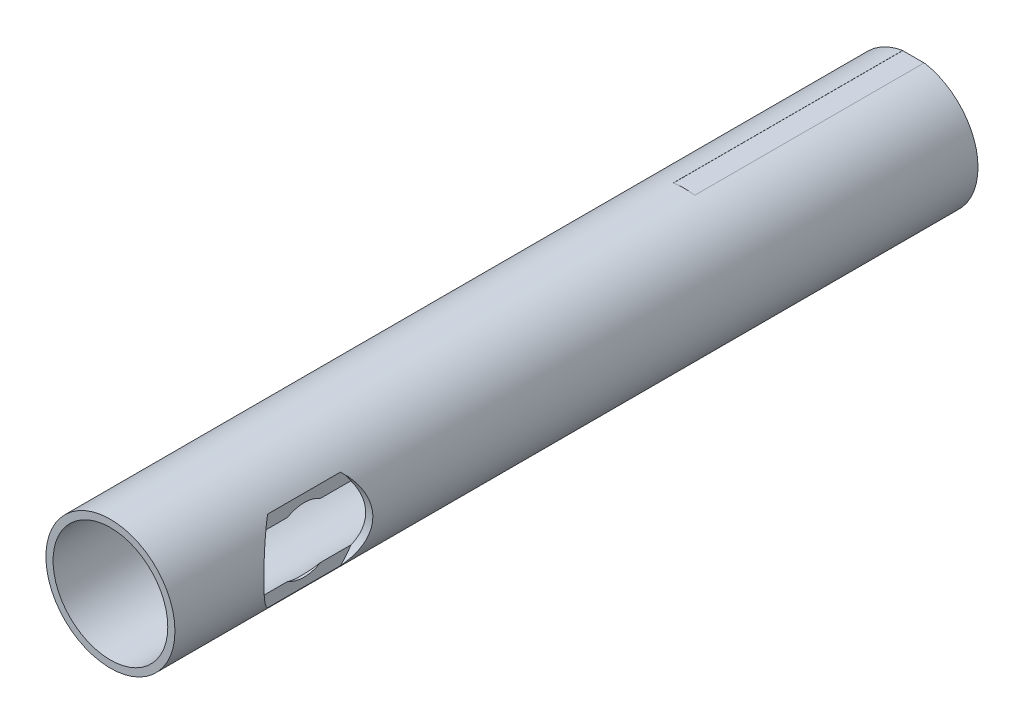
ISO-10303-21;
HEADER;
FILE_DESCRIPTION(('STEP AP214'),'2;1');
FILE_NAME('part.step','',(''),(''),'','','');
FILE_SCHEMA(('AUTOMOTIVE_DESIGN { 1 0 10303 214 1 1 1 1 }'));
ENDSEC;
DATA;
#1=APPLICATION_CONTEXT('core data for automotive mechanical design processes');
#2=APPLICATION_PROTOCOL_DEFINITION('international standard','automotive_design',2000,#1);
#3=PRODUCT_CONTEXT('',#1,'mechanical');
#4=PRODUCT('Part','Part','',(#3));
#5=PRODUCT_RELATED_PRODUCT_CATEGORY('part','',(#4));
#6=PRODUCT_DEFINITION_FORMATION('','',#4);
#7=PRODUCT_DEFINITION_CONTEXT('part definition',#1,'design');
#8=PRODUCT_DEFINITION('design','',#6,#7);
#9=PRODUCT_DEFINITION_SHAPE('','',#8);
#10=(LENGTH_UNIT() NAMED_UNIT(*) SI_UNIT(.MILLI.,.METRE.));
#11=(NAMED_UNIT(*) PLANE_ANGLE_UNIT() SI_UNIT($,.RADIAN.));
#12=(NAMED_UNIT(*) SI_UNIT($,.STERADIAN.) SOLID_ANGLE_UNIT());
#13=UNCERTAINTY_MEASURE_WITH_UNIT(LENGTH_MEASURE(1.E-05),#10,'distance_accuracy_value','');
#14=(GEOMETRIC_REPRESENTATION_CONTEXT(3) GLOBAL_UNCERTAINTY_ASSIGNED_CONTEXT((#13)) GLOBAL_UNIT_ASSIGNED_CONTEXT((#10,
#11,#12)) REPRESENTATION_CONTEXT('',''));
#15=CARTESIAN_POINT('',(0.,0.,0.));
#16=DIRECTION('',(0.,0.,1.));
#17=DIRECTION('',(1.,0.,0.));
#18=AXIS2_PLACEMENT_3D('',#15,#16,#17);
#19=CARTESIAN_POINT('',(0.,0.,-355.6));
#20=DIRECTION('',(0.,0.,1.));
#21=DIRECTION('',(1.,0.,0.));
#22=AXIS2_PLACEMENT_3D('',#19,#20,#21);
#23=CYLINDRICAL_SURFACE('',#22,28.575);
#24=DIRECTION('',(0.,0.,1.));
#25=VECTOR('',#24,1.);
#26=CARTESIAN_POINT('',(-4.74980000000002,28.1774737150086,-355.6));
#27=LINE('',#26,#25);
#28=CARTESIAN_POINT('',(-4.74980000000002,28.1774737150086,-355.6));
#29=VERTEX_POINT('',#28);
#30=CARTESIAN_POINT('',(-4.74980000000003,28.1774737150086,-254.));
#31=VERTEX_POINT('',#30);
#32=EDGE_CURVE('E328',#29,#31,#27,.T.);
#33=ORIENTED_EDGE('',*,*,#32,.F.);
#34=CARTESIAN_POINT('',(0.,0.,-355.6));
#35=DIRECTION('',(0.,0.,1.));
#36=DIRECTION('',(1.,0.,0.));
#37=AXIS2_PLACEMENT_3D('',#34,#35,#36);
#38=CIRCLE('',#37,28.575);
#39=CARTESIAN_POINT('',(-4.74980000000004,-28.1774737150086,-355.6));
#40=VERTEX_POINT('',#39);
#41=EDGE_CURVE('E158',#29,#40,#38,.T.);
#42=ORIENTED_EDGE('',*,*,#41,.T.);
#43=DIRECTION('',(0.,0.,1.));
#44=VECTOR('',#43,1.);
#45=CARTESIAN_POINT('',(-4.74980000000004,-28.1774737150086,-355.6));
#46=LINE('',#45,#44);
#47=CARTESIAN_POINT('',(-4.74980000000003,-28.1774737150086,-254.));
#48=VERTEX_POINT('',#47);
#49=EDGE_CURVE('E278',#48,#40,#46,.F.);
#50=ORIENTED_EDGE('',*,*,#49,.F.);
#51=CARTESIAN_POINT('',(0.,0.,-254.));
#52=DIRECTION('',(0.,0.,1.));
#53=DIRECTION('',(1.,0.,0.));
#54=AXIS2_PLACEMENT_3D('',#51,#52,#53);
#55=CIRCLE('',#54,28.575);
#56=CARTESIAN_POINT('',(4.74979999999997,-28.1774737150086,-254.));
#57=VERTEX_POINT('',#56);
#58=EDGE_CURVE('E160',#57,#48,#55,.F.);
#59=ORIENTED_EDGE('',*,*,#58,.F.);
#60=DIRECTION('',(0.,0.,1.));
#61=VECTOR('',#60,1.);
#62=CARTESIAN_POINT('',(4.74979999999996,-28.1774737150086,-355.6));
#63=LINE('',#62,#61);
#64=CARTESIAN_POINT('',(4.74979999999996,-28.1774737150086,-355.6));
#65=VERTEX_POINT('',#64);
#66=EDGE_CURVE('E465',#65,#57,#63,.T.);
#67=ORIENTED_EDGE('',*,*,#66,.F.);
#68=CARTESIAN_POINT('',(4.74979999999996,28.1774737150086,-355.6));
#69=VERTEX_POINT('',#68);
#70=EDGE_CURVE('E229',#65,#69,#38,.T.);
#71=ORIENTED_EDGE('',*,*,#70,.T.);
#72=DIRECTION('',(0.,0.,1.));
#73=VECTOR('',#72,1.);
#74=CARTESIAN_POINT('',(4.74979999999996,28.1774737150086,-355.6));
#75=LINE('',#74,#73);
#76=CARTESIAN_POINT('',(4.74979999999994,28.1774737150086,-254.));
#77=VERTEX_POINT('',#76);
#78=EDGE_CURVE('E448',#77,#69,#75,.F.);
#79=ORIENTED_EDGE('',*,*,#78,.F.);
#80=CARTESIAN_POINT('',(0.,0.,-254.));
#81=DIRECTION('',(0.,0.,1.));
#82=DIRECTION('',(1.,0.,0.));
#83=AXIS2_PLACEMENT_3D('',#80,#81,#82);
#84=CIRCLE('',#83,28.575);
#85=EDGE_CURVE('E11',#31,#77,#84,.F.);
#86=ORIENTED_EDGE('',*,*,#85,.F.);
#87=EDGE_LOOP('',(#33,#42,#50,#59,#67,#71,#79,#86));
#88=FACE_BOUND('',#87,.T.);
#89=CARTESIAN_POINT('',(0.,0.,0.));
#90=DIRECTION('',(0.,0.,1.));
#91=DIRECTION('',(1.,0.,0.));
#92=AXIS2_PLACEMENT_3D('',#89,#90,#91);
#93=CIRCLE('',#92,28.575);
#94=CARTESIAN_POINT('',(28.575,0.,0.));
#95=VERTEX_POINT('',#94);
#96=EDGE_CURVE('E226',#95,#95,#93,.T.);
#97=ORIENTED_EDGE('',*,*,#96,.F.);
#98=EDGE_LOOP('',(#97));
#99=FACE_BOUND('',#98,.T.);
#100=CARTESIAN_POINT('',(22.225,-17.9605122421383,-47.3855065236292));
#101=CARTESIAN_POINT('',(22.3970312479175,-17.7476348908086,-47.1482542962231));
#102=CARTESIAN_POINT('',(22.5680680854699,-17.5297298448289,-46.9148333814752));
#103=CARTESIAN_POINT('',(22.9074990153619,-17.0837833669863,-46.4558296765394));
#104=CARTESIAN_POINT('',(23.0758928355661,-16.8557409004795,-46.2302476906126));
#105=CARTESIAN_POINT('',(23.5764540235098,-16.1558242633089,-45.565092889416));
#106=CARTESIAN_POINT('',(23.9036080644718,-15.6686431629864,-45.137650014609));
#107=CARTESIAN_POINT('',(24.5413552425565,-14.6498009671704,-44.3147858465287));
#108=CARTESIAN_POINT('',(24.8517964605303,-14.11781775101,-43.9196453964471));
#109=CARTESIAN_POINT('',(25.4474190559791,-13.0135555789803,-43.169000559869));
#110=CARTESIAN_POINT('',(25.732613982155,-12.4412985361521,-42.8134748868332));
#111=CARTESIAN_POINT('',(26.221628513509,-11.3682341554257,-42.2085573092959));
#112=CARTESIAN_POINT('',(26.4307057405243,-10.8740010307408,-41.9517365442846));
#113=CARTESIAN_POINT('',(26.8250744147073,-9.86109916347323,-41.4697914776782));
#114=CARTESIAN_POINT('',(27.0103664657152,-9.34243104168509,-41.2446663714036));
#115=CARTESIAN_POINT('',(27.353427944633,-8.28426349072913,-40.8295365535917));
#116=CARTESIAN_POINT('',(27.5112759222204,-7.74482909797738,-40.6394315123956));
#117=CARTESIAN_POINT('',(27.7970553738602,-6.64652209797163,-40.296302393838));
#118=CARTESIAN_POINT('',(27.9249871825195,-6.08764970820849,-40.1432779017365));
#119=CARTESIAN_POINT('',(28.1491183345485,-4.949433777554,-39.875764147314));
#120=CARTESIAN_POINT('',(28.2450483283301,-4.36995977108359,-39.7616018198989));
#121=CARTESIAN_POINT('',(28.4014532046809,-3.19947640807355,-39.5757163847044));
#122=CARTESIAN_POINT('',(28.4619277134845,-2.60846692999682,-39.5039937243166));
#123=CARTESIAN_POINT('',(28.5459138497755,-1.41999435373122,-39.4044363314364));
#124=CARTESIAN_POINT('',(28.569416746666,-0.822529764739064,-39.3766119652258));
#125=CARTESIAN_POINT('',(28.5788158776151,0.373076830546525,-39.3654809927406));
#126=CARTESIAN_POINT('',(28.5647158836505,0.97121876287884,-39.3821699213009));
#127=CARTESIAN_POINT('',(28.5031634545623,2.09220282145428,-39.4551062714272));
#128=CARTESIAN_POINT('',(28.4598420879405,2.6156033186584,-39.5064544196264));
#129=CARTESIAN_POINT('',(28.3451206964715,3.65485942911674,-39.6426427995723));
#130=CARTESIAN_POINT('',(28.2737233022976,4.17071574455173,-39.727479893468));
#131=CARTESIAN_POINT('',(28.1042310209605,5.19137624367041,-39.9293174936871));
#132=CARTESIAN_POINT('',(28.0061467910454,5.6961847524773,-40.0463051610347));
#133=CARTESIAN_POINT('',(27.7850022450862,6.69212381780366,-40.310823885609));
#134=CARTESIAN_POINT('',(27.6619407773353,7.18325374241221,-40.4583563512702));
#135=CARTESIAN_POINT('',(27.3889754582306,8.16338534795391,-40.7867697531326));
#136=CARTESIAN_POINT('',(27.238400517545,8.65191821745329,-40.9684888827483));
#137=CARTESIAN_POINT('',(26.9153142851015,9.61000044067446,-41.3601564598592));
#138=CARTESIAN_POINT('',(26.7428024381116,10.0795493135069,-41.5701056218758));
#139=CARTESIAN_POINT('',(26.3780055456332,10.9989292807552,-42.016470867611));
#140=CARTESIAN_POINT('',(26.1856891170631,11.4487274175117,-42.252929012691));
#141=CARTESIAN_POINT('',(25.7839697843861,12.3268283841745,-42.7500407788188));
#142=CARTESIAN_POINT('',(25.5745648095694,12.7551285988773,-43.0106973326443));
#143=CARTESIAN_POINT('',(25.1224825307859,13.6254233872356,-43.577721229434));
#144=CARTESIAN_POINT('',(24.8784925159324,14.0654290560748,-43.886091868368));
#145=CARTESIAN_POINT('',(24.3762761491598,14.9188815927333,-44.5271573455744));
#146=CARTESIAN_POINT('',(24.1180469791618,15.3323231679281,-44.8598570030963));
#147=CARTESIAN_POINT('',(23.59171120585,16.1303766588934,-45.5460707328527));
#148=CARTESIAN_POINT('',(23.3236604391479,16.515122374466,-45.8994724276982));
#149=CARTESIAN_POINT('',(22.7795960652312,17.2578289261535,-46.6271267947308));
#150=CARTESIAN_POINT('',(22.5035872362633,17.6158053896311,-47.0013670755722));
#151=CARTESIAN_POINT('',(22.225,17.9605122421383,-47.3855065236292));
#152=B_SPLINE_CURVE_WITH_KNOTS('',3,(#100,#101,#102,#103,#104,#105,#106,#107,#108,#109,#110,
#111,#112,#113,#114,#115,#116,#117,#118,#119,#120,#121,#122,#123,#124,#125,#126,#127,#128,#129,
#130,#131,#132,#133,#134,#135,#136,#137,#138,#139,#140,#141,#142,#143,#144,#145,#146,#147,#148,
#149,#150,#151),.UNSPECIFIED.,.F.,.F.,(4,2,2,2,2,2,2,2,2,2,2,2,2,2,2,2,2,2,2,2,2,2,2,2,2,4),(0.,
1.08653033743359,2.17317182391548,4.34891799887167,6.54191965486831,8.73373718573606,
10.5168549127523,12.2999273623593,14.0778091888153,15.8556711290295,17.6481399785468,
19.4406277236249,21.2335386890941,23.0262698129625,24.6075001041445,26.1885822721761,
27.7690339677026,29.3495585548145,30.975610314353,32.6017032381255,34.2304137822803,
35.8593219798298,37.6282867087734,39.3976027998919,41.1580732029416,42.9175077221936),.UNSPECIFIED.);
#153=CARTESIAN_POINT('',(22.225,-17.9605122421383,-47.3855065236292));
#154=VERTEX_POINT('',#153);
#155=CARTESIAN_POINT('',(22.225,17.9605122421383,-47.3855065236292));
#156=VERTEX_POINT('',#155);
#157=EDGE_CURVE('E213',#154,#156,#152,.T.);
#158=ORIENTED_EDGE('',*,*,#157,.T.);
#159=DIRECTION('',(0.,0.,1.));
#160=VECTOR('',#159,1.);
#161=CARTESIAN_POINT('',(22.225,17.9605122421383,-355.6));
#162=LINE('',#161,#160);
#163=CARTESIAN_POINT('',(22.225,17.9605122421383,-79.6144934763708));
#164=VERTEX_POINT('',#163);
#165=EDGE_CURVE('E214',#156,#164,#162,.F.);
#166=ORIENTED_EDGE('',*,*,#165,.T.);
#167=CARTESIAN_POINT('',(22.225,17.9605122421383,-79.6144934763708));
#168=CARTESIAN_POINT('',(22.3970312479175,17.7476348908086,-79.8517457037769));
#169=CARTESIAN_POINT('',(22.5680680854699,17.5297298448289,-80.0851666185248));
#170=CARTESIAN_POINT('',(22.9074990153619,17.0837833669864,-80.5441703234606));
#171=CARTESIAN_POINT('',(23.0758928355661,16.8557409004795,-80.7697523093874));
#172=CARTESIAN_POINT('',(23.5764540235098,16.1558242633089,-81.434907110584));
#173=CARTESIAN_POINT('',(23.9036080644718,15.6686431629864,-81.862349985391));
#174=CARTESIAN_POINT('',(24.5413552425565,14.6498009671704,-82.6852141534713));
#175=CARTESIAN_POINT('',(24.8517964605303,14.11781775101,-83.0803546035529));
#176=CARTESIAN_POINT('',(25.4474190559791,13.0135555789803,-83.8309994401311));
#177=CARTESIAN_POINT('',(25.732613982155,12.4412985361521,-84.1865251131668));
#178=CARTESIAN_POINT('',(26.221628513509,11.3682341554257,-84.7914426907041));
#179=CARTESIAN_POINT('',(26.4307057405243,10.8740010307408,-85.0482634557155));
#180=CARTESIAN_POINT('',(26.8250744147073,9.86109916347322,-85.5302085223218));
#181=CARTESIAN_POINT('',(27.0103664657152,9.34243104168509,-85.7553336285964));
#182=CARTESIAN_POINT('',(27.353427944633,8.28426349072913,-86.1704634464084));
#183=CARTESIAN_POINT('',(27.5112759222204,7.74482909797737,-86.3605684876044));
#184=CARTESIAN_POINT('',(27.7970553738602,6.64652209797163,-86.703697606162));
#185=CARTESIAN_POINT('',(27.9249871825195,6.08764970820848,-86.8567220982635));
#186=CARTESIAN_POINT('',(28.1491183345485,4.949433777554,-87.124235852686));
#187=CARTESIAN_POINT('',(28.2450483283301,4.36995977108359,-87.2383981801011));
#188=CARTESIAN_POINT('',(28.4014532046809,3.19947640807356,-87.4242836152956));
#189=CARTESIAN_POINT('',(28.4619277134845,2.60846692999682,-87.4960062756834));
#190=CARTESIAN_POINT('',(28.5459138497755,1.41999435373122,-87.5955636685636));
#191=CARTESIAN_POINT('',(28.569416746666,0.822529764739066,-87.6233880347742));
#192=CARTESIAN_POINT('',(28.5788158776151,-0.373076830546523,-87.6345190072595));
#193=CARTESIAN_POINT('',(28.5647158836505,-0.971218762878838,-87.6178300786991));
#194=CARTESIAN_POINT('',(28.5031634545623,-2.09220282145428,-87.5448937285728));
#195=CARTESIAN_POINT('',(28.4598420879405,-2.6156033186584,-87.4935455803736));
#196=CARTESIAN_POINT('',(28.3451206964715,-3.65485942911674,-87.3573572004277));
#197=CARTESIAN_POINT('',(28.2737233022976,-4.17071574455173,-87.272520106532));
#198=CARTESIAN_POINT('',(28.1042310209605,-5.19137624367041,-87.0706825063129));
#199=CARTESIAN_POINT('',(28.0061467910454,-5.6961847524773,-86.9536948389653));
#200=CARTESIAN_POINT('',(27.7850022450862,-6.69212381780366,-86.689176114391));
#201=CARTESIAN_POINT('',(27.6619407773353,-7.18325374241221,-86.5416436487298));
#202=CARTESIAN_POINT('',(27.3889754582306,-8.16338534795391,-86.2132302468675));
#203=CARTESIAN_POINT('',(27.238400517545,-8.65191821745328,-86.0315111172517));
#204=CARTESIAN_POINT('',(26.9153142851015,-9.61000044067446,-85.6398435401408));
#205=CARTESIAN_POINT('',(26.7428024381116,-10.0795493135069,-85.4298943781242));
#206=CARTESIAN_POINT('',(26.3780055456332,-10.9989292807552,-84.983529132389));
#207=CARTESIAN_POINT('',(26.1856891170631,-11.4487274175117,-84.747070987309));
#208=CARTESIAN_POINT('',(25.7839697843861,-12.3268283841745,-84.2499592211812));
#209=CARTESIAN_POINT('',(25.5745648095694,-12.7551285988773,-83.9893026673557));
#210=CARTESIAN_POINT('',(25.1224825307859,-13.6254233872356,-83.422278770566));
#211=CARTESIAN_POINT('',(24.8784925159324,-14.0654290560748,-83.113908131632));
#212=CARTESIAN_POINT('',(24.3762761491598,-14.9188815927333,-82.4728426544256));
#213=CARTESIAN_POINT('',(24.1180469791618,-15.3323231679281,-82.1401429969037));
#214=CARTESIAN_POINT('',(23.59171120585,-16.1303766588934,-81.4539292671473));
#215=CARTESIAN_POINT('',(23.3236604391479,-16.515122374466,-81.1005275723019));
#216=CARTESIAN_POINT('',(22.7795960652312,-17.2578289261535,-80.3728732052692));
#217=CARTESIAN_POINT('',(22.5035872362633,-17.6158053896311,-79.9986329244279));
#218=CARTESIAN_POINT('',(22.225,-17.9605122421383,-79.6144934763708));
#219=B_SPLINE_CURVE_WITH_KNOTS('',3,(#167,#168,#169,#170,#171,#172,#173,#174,#175,#176,#177,
#178,#179,#180,#181,#182,#183,#184,#185,#186,#187,#188,#189,#190,#191,#192,#193,#194,#195,#196,
#197,#198,#199,#200,#201,#202,#203,#204,#205,#206,#207,#208,#209,#210,#211,#212,#213,#214,#215,
#216,#217,#218),.UNSPECIFIED.,.F.,.F.,(4,2,2,2,2,2,2,2,2,2,2,2,2,2,2,2,2,2,2,2,2,2,2,2,2,4),(0.,
1.08653033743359,2.17317182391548,4.34891799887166,6.54191965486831,8.73373718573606,
10.5168549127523,12.2999273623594,14.0778091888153,15.8556711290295,17.6481399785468,
19.4406277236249,21.2335386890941,23.0262698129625,24.6075001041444,26.1885822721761,
27.7690339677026,29.3495585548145,30.975610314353,32.6017032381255,34.2304137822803,
35.8593219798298,37.6282867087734,39.3976027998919,41.1580732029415,42.9175077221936),.UNSPECIFIED.);
#220=CARTESIAN_POINT('',(22.225,-17.9605122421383,-79.6144934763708));
#221=VERTEX_POINT('',#220);
#222=EDGE_CURVE('E206',#164,#221,#219,.T.);
#223=ORIENTED_EDGE('',*,*,#222,.T.);
#224=DIRECTION('',(0.,0.,1.));
#225=VECTOR('',#224,1.);
#226=CARTESIAN_POINT('',(22.225,-17.9605122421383,-355.6));
#227=LINE('',#226,#225);
#228=EDGE_CURVE('E264',#221,#154,#227,.T.);
#229=ORIENTED_EDGE('',*,*,#228,.T.);
#230=EDGE_LOOP('',(#158,#166,#223,#229));
#231=FACE_BOUND('',#230,.T.);
#232=ADVANCED_FACE('F37',(#88,#99,#231),#23,.T.);
#233=CARTESIAN_POINT('',(0.,0.,-355.6));
#234=DIRECTION('',(0.,0.,1.));
#235=DIRECTION('',(1.,0.,0.));
#236=AXIS2_PLACEMENT_3D('',#233,#234,#235);
#237=CYLINDRICAL_SURFACE('',#236,25.4);
#238=CARTESIAN_POINT('',(0.,0.,0.));
#239=DIRECTION('',(0.,0.,1.));
#240=DIRECTION('',(1.,0.,0.));
#241=AXIS2_PLACEMENT_3D('',#238,#239,#240);
#242=CIRCLE('',#241,25.4);
#243=CARTESIAN_POINT('',(25.4,0.,0.));
#244=VERTEX_POINT('',#243);
#245=EDGE_CURVE('E222',#244,#244,#242,.T.);
#246=ORIENTED_EDGE('',*,*,#245,.T.);
#247=EDGE_LOOP('',(#246));
#248=FACE_BOUND('',#247,.T.);
#249=CARTESIAN_POINT('',(0.,0.,-355.6));
#250=DIRECTION('',(0.,0.,1.));
#251=DIRECTION('',(1.,0.,0.));
#252=AXIS2_PLACEMENT_3D('',#249,#250,#251);
#253=CIRCLE('',#252,25.4);
#254=CARTESIAN_POINT('',(25.4,0.,-355.6));
#255=VERTEX_POINT('',#254);
#256=EDGE_CURVE('E223',#255,#255,#253,.T.);
#257=ORIENTED_EDGE('',*,*,#256,.F.);
#258=EDGE_LOOP('',(#257));
#259=FACE_BOUND('',#258,.T.);
#260=DIRECTION('',(0.,0.,1.));
#261=VECTOR('',#260,1.);
#262=CARTESIAN_POINT('',(22.225,12.2967221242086,-355.6));
#263=LINE('',#262,#261);
#264=CARTESIAN_POINT('',(22.225,12.2967221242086,-70.7748389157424));
#265=VERTEX_POINT('',#264);
#266=CARTESIAN_POINT('',(22.225,12.2967221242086,-84.2616840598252));
#267=VERTEX_POINT('',#266);
#268=EDGE_CURVE('E174',#265,#267,#263,.F.);
#269=ORIENTED_EDGE('',*,*,#268,.F.);
#270=CARTESIAN_POINT('',(22.225,12.2967221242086,-70.7748389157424));
#271=CARTESIAN_POINT('',(22.1255517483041,12.4764589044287,-70.4710415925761));
#272=CARTESIAN_POINT('',(22.0292219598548,12.6454190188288,-70.1597408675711));
#273=CARTESIAN_POINT('',(21.8451988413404,12.9607364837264,-69.5231383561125));
#274=CARTESIAN_POINT('',(21.7575122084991,13.107076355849,-69.1978259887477));
#275=CARTESIAN_POINT('',(21.5929627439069,13.3764340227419,-68.5331714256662));
#276=CARTESIAN_POINT('',(21.5161508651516,13.4993429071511,-68.1937722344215));
#277=CARTESIAN_POINT('',(21.3763016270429,13.7197224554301,-67.5041071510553));
#278=CARTESIAN_POINT('',(21.3132610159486,13.817199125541,-67.1538438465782));
#279=CARTESIAN_POINT('',(21.2028820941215,13.9859944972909,-66.4425985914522));
#280=CARTESIAN_POINT('',(21.1556287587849,14.0571718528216,-66.0815696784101));
#281=CARTESIAN_POINT('',(21.0791480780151,14.17160115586,-65.3531794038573));
#282=CARTESIAN_POINT('',(21.0499216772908,14.2148516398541,-64.9858177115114));
#283=CARTESIAN_POINT('',(21.0107904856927,14.2726279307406,-64.2489382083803));
#284=CARTESIAN_POINT('',(21.0008269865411,14.2872410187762,-63.8794304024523));
#285=CARTESIAN_POINT('',(21.0004797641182,14.2877520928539,-63.1404108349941));
#286=CARTESIAN_POINT('',(21.010094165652,14.2736528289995,-62.7708990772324));
#287=CARTESIAN_POINT('',(21.0468234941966,14.2194286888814,-62.0667118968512));
#288=CARTESIAN_POINT('',(21.0723647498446,14.1816426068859,-61.7317697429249));
#289=CARTESIAN_POINT('',(21.138544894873,14.0828069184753,-61.0668592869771));
#290=CARTESIAN_POINT('',(21.1791837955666,14.0217572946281,-60.7368909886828));
#291=CARTESIAN_POINT('',(21.2743033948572,13.877013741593,-60.0833679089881));
#292=CARTESIAN_POINT('',(21.3288094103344,13.7932783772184,-59.759826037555));
#293=CARTESIAN_POINT('',(21.4499387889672,13.6041430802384,-59.1215581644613));
#294=CARTESIAN_POINT('',(21.5165603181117,13.4987464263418,-58.8068308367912));
#295=CARTESIAN_POINT('',(21.6804990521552,13.234296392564,-58.0994153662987));
#296=CARTESIAN_POINT('',(21.7811574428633,13.0685079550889,-57.710012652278));
#297=CARTESIAN_POINT('',(21.9948089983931,12.7056024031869,-56.9520028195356));
#298=CARTESIAN_POINT('',(22.107741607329,12.5086370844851,-56.5833061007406));
#299=CARTESIAN_POINT('',(22.225,12.2967221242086,-56.2251610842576));
#300=B_SPLINE_CURVE_WITH_KNOTS('',3,(#270,#271,#272,#273,#274,#275,#276,#277,#278,#279,#280,
#281,#282,#283,#284,#285,#286,#287,#288,#289,#290,#291,#292,#293,#294,#295,#296,#297,#298,#299),
.UNSPECIFIED.,.F.,.F.,(4,2,2,2,2,2,2,2,2,2,2,2,2,2,4),(0.,1.10006504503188,2.20097589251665,
3.30688540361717,4.41253349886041,5.524040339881,6.63560542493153,7.74377737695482,
8.85184319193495,9.86475893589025,10.8776754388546,11.8924546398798,12.9070803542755,
14.2102784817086,15.5073163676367),.UNSPECIFIED.);
#301=CARTESIAN_POINT('',(22.225,12.2967221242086,-56.2251610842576));
#302=VERTEX_POINT('',#301);
#303=EDGE_CURVE('E257',#265,#302,#300,.T.);
#304=ORIENTED_EDGE('',*,*,#303,.T.);
#305=CARTESIAN_POINT('',(22.225,12.2967221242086,-42.7383159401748));
#306=VERTEX_POINT('',#305);
#307=EDGE_CURVE('E171',#306,#302,#263,.F.);
#308=ORIENTED_EDGE('',*,*,#307,.F.);
#309=CARTESIAN_POINT('',(22.225,-12.2967221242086,-42.7383159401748));
#310=CARTESIAN_POINT('',(22.4635063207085,-11.8657051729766,-42.4830079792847));
#311=CARTESIAN_POINT('',(22.6922857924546,-11.4225504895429,-42.2386950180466));
#312=CARTESIAN_POINT('',(23.1278525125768,-10.5126934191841,-41.7744154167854));
#313=CARTESIAN_POINT('',(23.3346190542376,-10.0459694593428,-41.5544716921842));
#314=CARTESIAN_POINT('',(23.7243258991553,-9.08765825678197,-41.1405410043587));
#315=CARTESIAN_POINT('',(23.9071166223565,-8.59593923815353,-40.9467168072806));
#316=CARTESIAN_POINT('',(24.244514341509,-7.59234157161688,-40.5893726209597));
#317=CARTESIAN_POINT('',(24.3991291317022,-7.08046854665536,-40.4258442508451));
#318=CARTESIAN_POINT('',(24.6783325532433,-6.03603876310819,-40.130804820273));
#319=CARTESIAN_POINT('',(24.8027386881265,-5.50337780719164,-39.9994883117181));
#320=CARTESIAN_POINT('',(25.0178640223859,-4.42373383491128,-39.7725532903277));
#321=CARTESIAN_POINT('',(25.1085806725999,-3.87674973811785,-39.6769374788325));
#322=CARTESIAN_POINT('',(25.254104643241,-2.77456074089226,-39.5236098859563));
#323=CARTESIAN_POINT('',(25.3090259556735,-2.21938775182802,-39.4657777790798));
#324=CARTESIAN_POINT('',(25.3821486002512,-1.10398736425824,-39.3887886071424));
#325=CARTESIAN_POINT('',(25.4003540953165,-0.543760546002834,-39.3696271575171));
#326=CARTESIAN_POINT('',(25.3996678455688,0.525857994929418,-39.3703497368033));
#327=CARTESIAN_POINT('',(25.3839856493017,1.03525986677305,-39.3868556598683));
#328=CARTESIAN_POINT('',(25.3222302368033,2.05013646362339,-39.4518743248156));
#329=CARTESIAN_POINT('',(25.2761586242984,2.55561139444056,-39.5003853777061));
#330=CARTESIAN_POINT('',(25.1544342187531,3.55955875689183,-39.6286182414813));
#331=CARTESIAN_POINT('',(25.0787470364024,4.05802234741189,-39.7083763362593));
#332=CARTESIAN_POINT('',(24.8991719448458,5.04404413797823,-39.8977423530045));
#333=CARTESIAN_POINT('',(24.7952840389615,5.531602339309,-40.0073502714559));
#334=CARTESIAN_POINT('',(24.5623848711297,6.48757191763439,-40.2532971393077));
#335=CARTESIAN_POINT('',(24.4336698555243,6.95613712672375,-40.389321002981));
#336=CARTESIAN_POINT('',(24.1523093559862,7.87769663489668,-40.6869925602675));
#337=CARTESIAN_POINT('',(23.9996614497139,8.33068935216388,-40.8486428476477));
#338=CARTESIAN_POINT('',(23.672670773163,9.21891863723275,-41.1953913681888));
#339=CARTESIAN_POINT('',(23.4983490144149,9.65417186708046,-41.3804668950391));
#340=CARTESIAN_POINT('',(23.1300176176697,10.5060718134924,-41.7721594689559));
#341=CARTESIAN_POINT('',(22.9360143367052,10.9227244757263,-41.9787695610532));
#342=CARTESIAN_POINT('',(22.6512453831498,11.4941234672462,-42.2826310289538));
#343=CARTESIAN_POINT('',(22.5678426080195,11.6570019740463,-42.3716909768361));
#344=CARTESIAN_POINT('',(22.3983957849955,11.9793557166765,-42.5527793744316));
#345=CARTESIAN_POINT('',(22.3123554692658,12.1388352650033,-42.6448036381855));
#346=CARTESIAN_POINT('',(22.225,12.2967221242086,-42.7383159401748));
#347=B_SPLINE_CURVE_WITH_KNOTS('',3,(#309,#310,#311,#312,#313,#314,#315,#316,#317,#318,#319,
#320,#321,#322,#323,#324,#325,#326,#327,#328,#329,#330,#331,#332,#333,#334,#335,#336,#337,#338,
#339,#340,#341,#342,#343,#344,#345,#346),.UNSPECIFIED.,.F.,.F.,(4,2,2,2,2,2,2,2,2,2,2,2,2,2,2,2,
2,2,4),(0.,1.66446383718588,3.33047978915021,5.00643983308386,6.68193555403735,8.36731459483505,
10.0528211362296,11.7329335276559,13.41285541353,14.9406769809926,16.4684179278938,
17.997938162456,19.527458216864,21.0397455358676,22.5521860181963,24.0631715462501,
25.5736705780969,26.1841548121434,26.7938118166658),.UNSPECIFIED.);
#348=CARTESIAN_POINT('',(22.225,-12.2967221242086,-42.7383159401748));
#349=VERTEX_POINT('',#348);
#350=EDGE_CURVE('E175',#349,#306,#347,.T.);
#351=ORIENTED_EDGE('',*,*,#350,.F.);
#352=DIRECTION('',(0.,0.,1.));
#353=VECTOR('',#352,1.);
#354=CARTESIAN_POINT('',(22.225,-12.2967221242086,-355.6));
#355=LINE('',#354,#353);
#356=CARTESIAN_POINT('',(22.225,-12.2967221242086,-56.2251610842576));
#357=VERTEX_POINT('',#356);
#358=EDGE_CURVE('E232',#357,#349,#355,.T.);
#359=ORIENTED_EDGE('',*,*,#358,.F.);
#360=CARTESIAN_POINT('',(22.225,-12.2967221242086,-56.2251610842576));
#361=CARTESIAN_POINT('',(22.1255517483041,-12.4764589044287,-56.5289584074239));
#362=CARTESIAN_POINT('',(22.0292219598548,-12.6454190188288,-56.8402591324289));
#363=CARTESIAN_POINT('',(21.8451988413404,-12.9607364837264,-57.4768616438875));
#364=CARTESIAN_POINT('',(21.7575122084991,-13.107076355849,-57.8021740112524));
#365=CARTESIAN_POINT('',(21.5929627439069,-13.3764340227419,-58.4668285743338));
#366=CARTESIAN_POINT('',(21.5161508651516,-13.4993429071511,-58.8062277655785));
#367=CARTESIAN_POINT('',(21.3763016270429,-13.7197224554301,-59.4958928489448));
#368=CARTESIAN_POINT('',(21.3132610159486,-13.817199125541,-59.8461561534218));
#369=CARTESIAN_POINT('',(21.2028820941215,-13.9859944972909,-60.5574014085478));
#370=CARTESIAN_POINT('',(21.1556287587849,-14.0571718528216,-60.9184303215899));
#371=CARTESIAN_POINT('',(21.0791480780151,-14.17160115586,-61.6468205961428));
#372=CARTESIAN_POINT('',(21.0499216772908,-14.2148516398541,-62.0141822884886));
#373=CARTESIAN_POINT('',(21.0107904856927,-14.2726279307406,-62.7510617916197));
#374=CARTESIAN_POINT('',(21.0008269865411,-14.2872410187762,-63.1205695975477));
#375=CARTESIAN_POINT('',(21.0004797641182,-14.2877520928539,-63.8595891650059));
#376=CARTESIAN_POINT('',(21.010094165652,-14.2736528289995,-64.2291009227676));
#377=CARTESIAN_POINT('',(21.0468234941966,-14.2194286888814,-64.9332881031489));
#378=CARTESIAN_POINT('',(21.0723647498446,-14.1816426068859,-65.2682302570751));
#379=CARTESIAN_POINT('',(21.138544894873,-14.0828069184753,-65.933140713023));
#380=CARTESIAN_POINT('',(21.1791837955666,-14.0217572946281,-66.2631090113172));
#381=CARTESIAN_POINT('',(21.2743033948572,-13.8770137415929,-66.9166320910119));
#382=CARTESIAN_POINT('',(21.3288094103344,-13.7932783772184,-67.2401739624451));
#383=CARTESIAN_POINT('',(21.4499387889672,-13.6041430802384,-67.8784418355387));
#384=CARTESIAN_POINT('',(21.5165603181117,-13.4987464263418,-68.1931691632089));
#385=CARTESIAN_POINT('',(21.6804990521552,-13.234296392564,-68.9005846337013));
#386=CARTESIAN_POINT('',(21.7811574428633,-13.0685079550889,-69.289987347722));
#387=CARTESIAN_POINT('',(21.9948089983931,-12.7056024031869,-70.0479971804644));
#388=CARTESIAN_POINT('',(22.107741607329,-12.5086370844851,-70.4166938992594));
#389=CARTESIAN_POINT('',(22.225,-12.2967221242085,-70.7748389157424));
#390=B_SPLINE_CURVE_WITH_KNOTS('',3,(#360,#361,#362,#363,#364,#365,#366,#367,#368,#369,#370,
#371,#372,#373,#374,#375,#376,#377,#378,#379,#380,#381,#382,#383,#384,#385,#386,#387,#388,#389),
.UNSPECIFIED.,.F.,.F.,(4,2,2,2,2,2,2,2,2,2,2,2,2,2,4),(0.,1.10006504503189,2.20097589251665,
3.30688540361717,4.41253349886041,5.52404033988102,6.63560542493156,7.74377737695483,
8.85184319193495,9.86475893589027,10.8776754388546,11.8924546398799,12.9070803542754,
14.2102784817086,15.5073163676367),.UNSPECIFIED.);
#391=CARTESIAN_POINT('',(22.225,-12.2967221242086,-70.7748389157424));
#392=VERTEX_POINT('',#391);
#393=EDGE_CURVE('E276',#357,#392,#390,.T.);
#394=ORIENTED_EDGE('',*,*,#393,.T.);
#395=CARTESIAN_POINT('',(22.225,-12.2967221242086,-84.2616840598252));
#396=VERTEX_POINT('',#395);
#397=EDGE_CURVE('E234',#396,#392,#355,.T.);
#398=ORIENTED_EDGE('',*,*,#397,.F.);
#399=CARTESIAN_POINT('',(22.225,12.2967221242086,-84.2616840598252));
#400=CARTESIAN_POINT('',(22.4635063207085,11.8657051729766,-84.5169920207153));
#401=CARTESIAN_POINT('',(22.6922857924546,11.4225504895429,-84.7613049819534));
#402=CARTESIAN_POINT('',(23.1278525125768,10.5126934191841,-85.2255845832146));
#403=CARTESIAN_POINT('',(23.3346190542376,10.0459694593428,-85.4455283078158));
#404=CARTESIAN_POINT('',(23.7243258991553,9.08765825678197,-85.8594589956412));
#405=CARTESIAN_POINT('',(23.9071166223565,8.59593923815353,-86.0532831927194));
#406=CARTESIAN_POINT('',(24.244514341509,7.59234157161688,-86.4106273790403));
#407=CARTESIAN_POINT('',(24.3991291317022,7.08046854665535,-86.5741557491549));
#408=CARTESIAN_POINT('',(24.6783325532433,6.03603876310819,-86.869195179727));
#409=CARTESIAN_POINT('',(24.8027386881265,5.50337780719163,-87.0005116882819));
#410=CARTESIAN_POINT('',(25.0178640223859,4.42373383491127,-87.2274467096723));
#411=CARTESIAN_POINT('',(25.1085806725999,3.87674973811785,-87.3230625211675));
#412=CARTESIAN_POINT('',(25.254104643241,2.77456074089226,-87.4763901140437));
#413=CARTESIAN_POINT('',(25.3090259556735,2.21938775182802,-87.5342222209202));
#414=CARTESIAN_POINT('',(25.3821486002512,1.10398736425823,-87.6112113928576));
#415=CARTESIAN_POINT('',(25.4003540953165,0.54376054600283,-87.6303728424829));
#416=CARTESIAN_POINT('',(25.3996678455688,-0.525857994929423,-87.6296502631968));
#417=CARTESIAN_POINT('',(25.3839856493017,-1.03525986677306,-87.6131443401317));
#418=CARTESIAN_POINT('',(25.3222302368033,-2.05013646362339,-87.5481256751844));
#419=CARTESIAN_POINT('',(25.2761586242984,-2.55561139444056,-87.4996146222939));
#420=CARTESIAN_POINT('',(25.1544342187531,-3.55955875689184,-87.3713817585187));
#421=CARTESIAN_POINT('',(25.0787470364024,-4.05802234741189,-87.2916236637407));
#422=CARTESIAN_POINT('',(24.8991719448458,-5.04404413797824,-87.1022576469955));
#423=CARTESIAN_POINT('',(24.7952840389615,-5.53160233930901,-86.9926497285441));
#424=CARTESIAN_POINT('',(24.5623848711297,-6.4875719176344,-86.7467028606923));
#425=CARTESIAN_POINT('',(24.4336698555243,-6.95613712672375,-86.610678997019));
#426=CARTESIAN_POINT('',(24.1523093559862,-7.87769663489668,-86.3130074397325));
#427=CARTESIAN_POINT('',(23.9996614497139,-8.33068935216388,-86.1513571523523));
#428=CARTESIAN_POINT('',(23.672670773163,-9.21891863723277,-85.8046086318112));
#429=CARTESIAN_POINT('',(23.4983490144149,-9.65417186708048,-85.6195331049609));
#430=CARTESIAN_POINT('',(23.1300176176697,-10.5060718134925,-85.2278405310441));
#431=CARTESIAN_POINT('',(22.9360143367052,-10.9227244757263,-85.0212304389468));
#432=CARTESIAN_POINT('',(22.6512453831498,-11.4941234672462,-84.7173689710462));
#433=CARTESIAN_POINT('',(22.5678426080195,-11.6570019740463,-84.6283090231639));
#434=CARTESIAN_POINT('',(22.3983957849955,-11.9793557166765,-84.4472206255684));
#435=CARTESIAN_POINT('',(22.3123554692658,-12.1388352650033,-84.3551963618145));
#436=CARTESIAN_POINT('',(22.225,-12.2967221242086,-84.2616840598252));
#437=B_SPLINE_CURVE_WITH_KNOTS('',3,(#399,#400,#401,#402,#403,#404,#405,#406,#407,#408,#409,
#410,#411,#412,#413,#414,#415,#416,#417,#418,#419,#420,#421,#422,#423,#424,#425,#426,#427,#428,
#429,#430,#431,#432,#433,#434,#435,#436),.UNSPECIFIED.,.F.,.F.,(4,2,2,2,2,2,2,2,2,2,2,2,2,2,2,2,
2,2,4),(0.,1.66446383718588,3.33047978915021,5.00643983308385,6.68193555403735,8.36731459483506,
10.0528211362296,11.7329335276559,13.41285541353,14.9406769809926,16.4684179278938,
17.997938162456,19.527458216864,21.0397455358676,22.5521860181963,24.0631715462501,
25.5736705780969,26.1841548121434,26.7938118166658),.UNSPECIFIED.);
#438=EDGE_CURVE('E183',#267,#396,#437,.T.);
#439=ORIENTED_EDGE('',*,*,#438,.F.);
#440=EDGE_LOOP('',(#269,#304,#308,#351,#359,#394,#398,#439));
#441=FACE_BOUND('',#440,.T.);
#442=ADVANCED_FACE('F189',(#248,#259,#441),#237,.F.);
#443=CARTESIAN_POINT('',(0.,0.,-355.6));
#444=DIRECTION('',(0.,0.,1.));
#445=DIRECTION('',(1.,0.,0.));
#446=AXIS2_PLACEMENT_3D('',#443,#444,#445);
#447=PLANE('',#446);
#448=ORIENTED_EDGE('',*,*,#41,.F.);
#449=DIRECTION('',(0.,-1.,0.));
#450=VECTOR('',#449,1.);
#451=CARTESIAN_POINT('',(-4.74980000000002,0.,-355.6));
#452=LINE('',#451,#450);
#453=CARTESIAN_POINT('',(-4.74980000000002,28.1178,-355.6));
#454=VERTEX_POINT('',#453);
#455=EDGE_CURVE('E45',#29,#454,#452,.T.);
#456=ORIENTED_EDGE('',*,*,#455,.T.);
#457=DIRECTION('',(1.,0.,0.));
#458=VECTOR('',#457,1.);
#459=CARTESIAN_POINT('',(-4.74980000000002,28.1178,-355.6));
#460=LINE('',#459,#458);
#461=CARTESIAN_POINT('',(4.74979999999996,28.1178,-355.6));
#462=VERTEX_POINT('',#461);
#463=EDGE_CURVE('E139',#454,#462,#460,.T.);
#464=ORIENTED_EDGE('',*,*,#463,.T.);
#465=DIRECTION('',(0.,1.,0.));
#466=VECTOR('',#465,1.);
#467=CARTESIAN_POINT('',(4.74979999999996,0.,-355.6));
#468=LINE('',#467,#466);
#469=EDGE_CURVE('E159',#462,#69,#468,.T.);
#470=ORIENTED_EDGE('',*,*,#469,.T.);
#471=ORIENTED_EDGE('',*,*,#70,.F.);
#472=DIRECTION('',(0.,1.,0.));
#473=VECTOR('',#472,1.);
#474=CARTESIAN_POINT('',(4.74979999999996,0.,-355.6));
#475=LINE('',#474,#473);
#476=CARTESIAN_POINT('',(4.74979999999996,-28.067,-355.6));
#477=VERTEX_POINT('',#476);
#478=EDGE_CURVE('E166',#65,#477,#475,.T.);
#479=ORIENTED_EDGE('',*,*,#478,.T.);
#480=DIRECTION('',(-1.,0.,0.));
#481=VECTOR('',#480,1.);
#482=CARTESIAN_POINT('',(-4.74980000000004,-28.067,-355.6));
#483=LINE('',#482,#481);
#484=CARTESIAN_POINT('',(-4.74980000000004,-28.067,-355.6));
#485=VERTEX_POINT('',#484);
#486=EDGE_CURVE('E459',#477,#485,#483,.T.);
#487=ORIENTED_EDGE('',*,*,#486,.T.);
#488=DIRECTION('',(0.,-1.,0.));
#489=VECTOR('',#488,1.);
#490=CARTESIAN_POINT('',(-4.74980000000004,0.,-355.6));
#491=LINE('',#490,#489);
#492=EDGE_CURVE('E164',#485,#40,#491,.T.);
#493=ORIENTED_EDGE('',*,*,#492,.T.);
#494=EDGE_LOOP('',(#448,#456,#464,#470,#471,#479,#487,#493));
#495=FACE_BOUND('',#494,.T.);
#496=ORIENTED_EDGE('',*,*,#256,.T.);
#497=EDGE_LOOP('',(#496));
#498=FACE_BOUND('',#497,.T.);
#499=ADVANCED_FACE('F155',(#495,#498),#447,.F.);
#500=CARTESIAN_POINT('',(0.,0.,0.));
#501=DIRECTION('',(0.,0.,1.));
#502=DIRECTION('',(1.,0.,0.));
#503=AXIS2_PLACEMENT_3D('',#500,#501,#502);
#504=PLANE('',#503);
#505=ORIENTED_EDGE('',*,*,#245,.F.);
#506=EDGE_LOOP('',(#505));
#507=FACE_BOUND('',#506,.T.);
#508=ORIENTED_EDGE('',*,*,#96,.T.);
#509=EDGE_LOOP('',(#508));
#510=FACE_BOUND('',#509,.T.);
#511=ADVANCED_FACE('F197',(#507,#510),#504,.T.);
#512=CARTESIAN_POINT('',(47.625,0.,-63.5));
#513=DIRECTION('',(-1.,0.,0.));
#514=DIRECTION('',(0.,0.,1.));
#515=AXIS2_PLACEMENT_3D('',#512,#513,#514);
#516=CYLINDRICAL_SURFACE('',#515,24.13);
#517=CARTESIAN_POINT('',(22.225,0.,-63.5));
#518=DIRECTION('',(1.,0.,0.));
#519=DIRECTION('',(0.,0.,-1.));
#520=AXIS2_PLACEMENT_3D('',#517,#518,#519);
#521=CIRCLE('',#520,24.13);
#522=EDGE_CURVE('E243',#349,#154,#521,.T.);
#523=ORIENTED_EDGE('',*,*,#522,.F.);
#524=ORIENTED_EDGE('',*,*,#350,.T.);
#525=EDGE_CURVE('E251',#156,#306,#521,.T.);
#526=ORIENTED_EDGE('',*,*,#525,.F.);
#527=ORIENTED_EDGE('',*,*,#157,.F.);
#528=EDGE_LOOP('',(#523,#524,#526,#527));
#529=FACE_BOUND('',#528,.T.);
#530=ADVANCED_FACE('F192',(#529),#516,.F.);
#531=EDGE_CURVE('E263',#267,#164,#521,.T.);
#532=ORIENTED_EDGE('',*,*,#531,.F.);
#533=ORIENTED_EDGE('',*,*,#438,.T.);
#534=EDGE_CURVE('E252',#221,#396,#521,.T.);
#535=ORIENTED_EDGE('',*,*,#534,.F.);
#536=ORIENTED_EDGE('',*,*,#222,.F.);
#537=EDGE_LOOP('',(#532,#533,#535,#536));
#538=FACE_BOUND('',#537,.T.);
#539=ADVANCED_FACE('F196',(#538),#516,.F.);
#540=CARTESIAN_POINT('',(22.225,0.,-63.5));
#541=DIRECTION('',(1.,0.,0.));
#542=DIRECTION('',(0.,0.,-1.));
#543=AXIS2_PLACEMENT_3D('',#540,#541,#542);
#544=PLANE('',#543);
#545=CARTESIAN_POINT('',(22.225,0.,-63.5));
#546=DIRECTION('',(1.,0.,0.));
#547=DIRECTION('',(0.,0.,-1.));
#548=AXIS2_PLACEMENT_3D('',#545,#546,#547);
#549=CIRCLE('',#548,14.2875);
#550=EDGE_CURVE('E260',#265,#302,#549,.T.);
#551=ORIENTED_EDGE('',*,*,#550,.F.);
#552=ORIENTED_EDGE('',*,*,#268,.T.);
#553=ORIENTED_EDGE('',*,*,#531,.T.);
#554=ORIENTED_EDGE('',*,*,#165,.F.);
#555=ORIENTED_EDGE('',*,*,#525,.T.);
#556=ORIENTED_EDGE('',*,*,#307,.T.);
#557=EDGE_LOOP('',(#551,#552,#553,#554,#555,#556));
#558=FACE_BOUND('',#557,.T.);
#559=ADVANCED_FACE('F199',(#558),#544,.T.);
#560=CARTESIAN_POINT('',(22.225,0.,-63.5));
#561=DIRECTION('',(1.,0.,0.));
#562=DIRECTION('',(0.,0.,-1.));
#563=AXIS2_PLACEMENT_3D('',#560,#561,#562);
#564=CIRCLE('',#563,14.2875);
#565=EDGE_CURVE('E169',#357,#392,#564,.T.);
#566=ORIENTED_EDGE('',*,*,#565,.F.);
#567=ORIENTED_EDGE('',*,*,#358,.T.);
#568=ORIENTED_EDGE('',*,*,#522,.T.);
#569=ORIENTED_EDGE('',*,*,#228,.F.);
#570=ORIENTED_EDGE('',*,*,#534,.T.);
#571=ORIENTED_EDGE('',*,*,#397,.T.);
#572=EDGE_LOOP('',(#566,#567,#568,#569,#570,#571));
#573=FACE_BOUND('',#572,.T.);
#574=ADVANCED_FACE('F242',(#573),#544,.T.);
#575=CARTESIAN_POINT('',(15.875,0.,-63.5));
#576=DIRECTION('',(1.,0.,0.));
#577=DIRECTION('',(0.,0.,-1.));
#578=AXIS2_PLACEMENT_3D('',#575,#576,#577);
#579=CYLINDRICAL_SURFACE('',#578,14.2875);
#580=ORIENTED_EDGE('',*,*,#565,.T.);
#581=ORIENTED_EDGE('',*,*,#393,.F.);
#582=EDGE_LOOP('',(#580,#581));
#583=FACE_BOUND('',#582,.T.);
#584=ADVANCED_FACE('F290',(#583),#579,.F.);
#585=ORIENTED_EDGE('',*,*,#550,.T.);
#586=ORIENTED_EDGE('',*,*,#303,.F.);
#587=EDGE_LOOP('',(#585,#586));
#588=FACE_BOUND('',#587,.T.);
#589=ADVANCED_FACE('F285',(#588),#579,.F.);
#590=CARTESIAN_POINT('',(-4.74980000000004,-28.575,-355.6));
#591=DIRECTION('',(-1.,0.,0.));
#592=DIRECTION('',(0.,0.,1.));
#593=AXIS2_PLACEMENT_3D('',#590,#591,#592);
#594=PLANE('',#593);
#595=ORIENTED_EDGE('',*,*,#49,.T.);
#596=ORIENTED_EDGE('',*,*,#492,.F.);
#597=DIRECTION('',(0.,0.,1.));
#598=VECTOR('',#597,1.);
#599=CARTESIAN_POINT('',(-4.74980000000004,-28.067,-355.6));
#600=LINE('',#599,#598);
#601=CARTESIAN_POINT('',(-4.74980000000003,-28.067,-254.));
#602=VERTEX_POINT('',#601);
#603=EDGE_CURVE('E60',#485,#602,#600,.T.);
#604=ORIENTED_EDGE('',*,*,#603,.T.);
#605=DIRECTION('',(0.,1.,0.));
#606=VECTOR('',#605,1.);
#607=CARTESIAN_POINT('',(-4.74980000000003,-28.575,-254.));
#608=LINE('',#607,#606);
#609=EDGE_CURVE('E462',#48,#602,#608,.T.);
#610=ORIENTED_EDGE('',*,*,#609,.F.);
#611=EDGE_LOOP('',(#595,#596,#604,#610));
#612=FACE_BOUND('',#611,.T.);
#613=ADVANCED_FACE('F289',(#612),#594,.F.);
#614=CARTESIAN_POINT('',(4.74979999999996,-28.575,-355.6));
#615=DIRECTION('',(1.,0.,0.));
#616=DIRECTION('',(0.,0.,-1.));
#617=AXIS2_PLACEMENT_3D('',#614,#615,#616);
#618=PLANE('',#617);
#619=ORIENTED_EDGE('',*,*,#66,.T.);
#620=DIRECTION('',(0.,1.,0.));
#621=VECTOR('',#620,1.);
#622=CARTESIAN_POINT('',(4.74979999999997,-28.575,-254.));
#623=LINE('',#622,#621);
#624=CARTESIAN_POINT('',(4.74979999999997,-28.067,-254.));
#625=VERTEX_POINT('',#624);
#626=EDGE_CURVE('E463',#57,#625,#623,.T.);
#627=ORIENTED_EDGE('',*,*,#626,.T.);
#628=DIRECTION('',(0.,0.,-1.));
#629=VECTOR('',#628,1.);
#630=CARTESIAN_POINT('',(4.74979999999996,-28.067,-355.6));
#631=LINE('',#630,#629);
#632=EDGE_CURVE('E457',#625,#477,#631,.T.);
#633=ORIENTED_EDGE('',*,*,#632,.T.);
#634=ORIENTED_EDGE('',*,*,#478,.F.);
#635=EDGE_LOOP('',(#619,#627,#633,#634));
#636=FACE_BOUND('',#635,.T.);
#637=ADVANCED_FACE('F295',(#636),#618,.F.);
#638=CARTESIAN_POINT('',(-4.74980000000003,-28.575,-254.));
#639=DIRECTION('',(0.,0.,1.));
#640=DIRECTION('',(1.,0.,0.));
#641=AXIS2_PLACEMENT_3D('',#638,#639,#640);
#642=PLANE('',#641);
#643=ORIENTED_EDGE('',*,*,#626,.F.);
#644=ORIENTED_EDGE('',*,*,#58,.T.);
#645=ORIENTED_EDGE('',*,*,#609,.T.);
#646=DIRECTION('',(1.,0.,0.));
#647=VECTOR('',#646,1.);
#648=CARTESIAN_POINT('',(-4.74980000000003,-28.067,-254.));
#649=LINE('',#648,#647);
#650=EDGE_CURVE('E450',#602,#625,#649,.T.);
#651=ORIENTED_EDGE('',*,*,#650,.T.);
#652=EDGE_LOOP('',(#643,#644,#645,#651));
#653=FACE_BOUND('',#652,.T.);
#654=ADVANCED_FACE('F297',(#653),#642,.F.);
#655=CARTESIAN_POINT('',(0.,-28.067,0.));
#656=DIRECTION('',(0.,1.,0.));
#657=DIRECTION('',(0.,0.,1.));
#658=AXIS2_PLACEMENT_3D('',#655,#656,#657);
#659=PLANE('',#658);
#660=ORIENTED_EDGE('',*,*,#603,.F.);
#661=ORIENTED_EDGE('',*,*,#486,.F.);
#662=ORIENTED_EDGE('',*,*,#632,.F.);
#663=ORIENTED_EDGE('',*,*,#650,.F.);
#664=EDGE_LOOP('',(#660,#661,#662,#663));
#665=FACE_BOUND('',#664,.T.);
#666=ADVANCED_FACE('F300',(#665),#659,.F.);
#667=CARTESIAN_POINT('',(-4.74980000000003,30.6578,-254.));
#668=DIRECTION('',(-1.,0.,0.));
#669=DIRECTION('',(0.,0.,1.));
#670=AXIS2_PLACEMENT_3D('',#667,#668,#669);
#671=PLANE('',#670);
#672=ORIENTED_EDGE('',*,*,#32,.T.);
#673=DIRECTION('',(0.,-1.,0.));
#674=VECTOR('',#673,1.);
#675=CARTESIAN_POINT('',(-4.74980000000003,30.6578,-254.));
#676=LINE('',#675,#674);
#677=CARTESIAN_POINT('',(-4.74980000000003,28.1178,-254.));
#678=VERTEX_POINT('',#677);
#679=EDGE_CURVE('E152',#31,#678,#676,.T.);
#680=ORIENTED_EDGE('',*,*,#679,.T.);
#681=DIRECTION('',(0.,0.,-1.));
#682=VECTOR('',#681,1.);
#683=CARTESIAN_POINT('',(-4.74980000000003,28.1178,-254.));
#684=LINE('',#683,#682);
#685=EDGE_CURVE('E142',#678,#454,#684,.T.);
#686=ORIENTED_EDGE('',*,*,#685,.T.);
#687=ORIENTED_EDGE('',*,*,#455,.F.);
#688=EDGE_LOOP('',(#672,#680,#686,#687));
#689=FACE_BOUND('',#688,.T.);
#690=ADVANCED_FACE('F149',(#689),#671,.F.);
#691=CARTESIAN_POINT('',(-4.74980000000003,30.6578,-254.));
#692=DIRECTION('',(0.,0.,1.));
#693=DIRECTION('',(1.,0.,0.));
#694=AXIS2_PLACEMENT_3D('',#691,#692,#693);
#695=PLANE('',#694);
#696=ORIENTED_EDGE('',*,*,#85,.T.);
#697=DIRECTION('',(0.,-1.,0.));
#698=VECTOR('',#697,1.);
#699=CARTESIAN_POINT('',(4.74979999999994,30.6578,-254.));
#700=LINE('',#699,#698);
#701=CARTESIAN_POINT('',(4.74979999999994,28.1178,-254.));
#702=VERTEX_POINT('',#701);
#703=EDGE_CURVE('E474',#77,#702,#700,.T.);
#704=ORIENTED_EDGE('',*,*,#703,.T.);
#705=DIRECTION('',(-1.,0.,0.));
#706=VECTOR('',#705,1.);
#707=CARTESIAN_POINT('',(-4.74980000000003,28.1178,-254.));
#708=LINE('',#707,#706);
#709=EDGE_CURVE('E475',#702,#678,#708,.T.);
#710=ORIENTED_EDGE('',*,*,#709,.T.);
#711=ORIENTED_EDGE('',*,*,#679,.F.);
#712=EDGE_LOOP('',(#696,#704,#710,#711));
#713=FACE_BOUND('',#712,.T.);
#714=ADVANCED_FACE('F309',(#713),#695,.F.);
#715=CARTESIAN_POINT('',(4.74979999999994,30.6578,-254.));
#716=DIRECTION('',(1.,0.,0.));
#717=DIRECTION('',(0.,0.,-1.));
#718=AXIS2_PLACEMENT_3D('',#715,#716,#717);
#719=PLANE('',#718);
#720=ORIENTED_EDGE('',*,*,#78,.T.);
#721=ORIENTED_EDGE('',*,*,#469,.F.);
#722=DIRECTION('',(0.,0.,1.));
#723=VECTOR('',#722,1.);
#724=CARTESIAN_POINT('',(4.74979999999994,28.1178,-254.));
#725=LINE('',#724,#723);
#726=EDGE_CURVE('E52',#462,#702,#725,.T.);
#727=ORIENTED_EDGE('',*,*,#726,.T.);
#728=ORIENTED_EDGE('',*,*,#703,.F.);
#729=EDGE_LOOP('',(#720,#721,#727,#728));
#730=FACE_BOUND('',#729,.T.);
#731=ADVANCED_FACE('F310',(#730),#719,.F.);
#732=CARTESIAN_POINT('',(0.,28.1178,0.));
#733=DIRECTION('',(0.,-1.,0.));
#734=DIRECTION('',(0.,0.,-1.));
#735=AXIS2_PLACEMENT_3D('',#732,#733,#734);
#736=PLANE('',#735);
#737=ORIENTED_EDGE('',*,*,#685,.F.);
#738=ORIENTED_EDGE('',*,*,#709,.F.);
#739=ORIENTED_EDGE('',*,*,#726,.F.);
#740=ORIENTED_EDGE('',*,*,#463,.F.);
#741=EDGE_LOOP('',(#737,#738,#739,#740));
#742=FACE_BOUND('',#741,.T.);
#743=ADVANCED_FACE('F141',(#742),#736,.F.);
#744=CLOSED_SHELL('',(#232,#442,#499,#511,#530,#539,#559,#574,#584,#589,#613,#637,#654,#666,
#690,#714,#731,#743));
#745=MANIFOLD_SOLID_BREP('B2',#744);
#746=ADVANCED_BREP_SHAPE_REPRESENTATION('',(#18,#745),#14);
#747=SHAPE_DEFINITION_REPRESENTATION(#9,#746);
ENDSEC;
END-ISO-10303-21;
